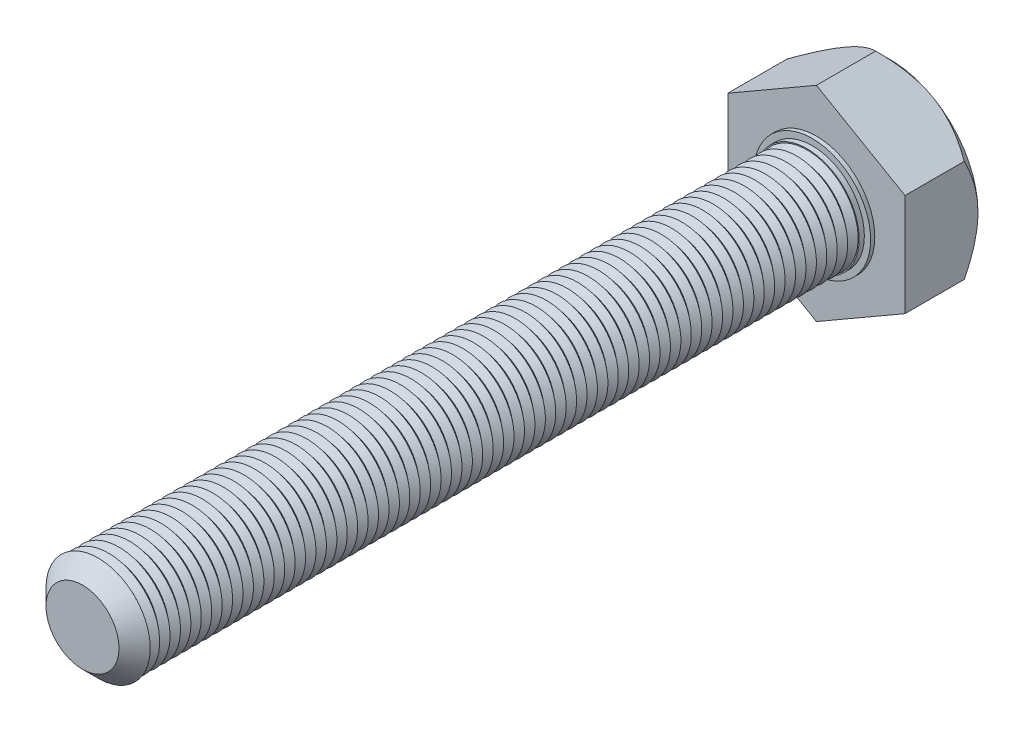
from build123d import *

# Parameters (mm, degrees)
BASE_EXTRUDE_DEPTH  = 3.5
SKETCH5_R           = 5.6
BOSS_EXTRUDE1_DEPTH = 0.4
SKETCH6_R           = 5
BOSS_EXTRUDE2_DEPTH = 70
CHAMFER1_SIZE       = 1.5
LPATTERN1_COUNT     = 68
LPATTERN1_PITCH     = 1


with BuildPart() as part:
    # Sketch1 → Base-Extrude (new, symmetric)
    with BuildSketch(Plane.XY):
        Polygon((8.5, 4.907477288), (8.5, -4.907477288), (0, -9.814954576), (-8.5, -4.907477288), (-8.5, 4.907477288), (0, 9.814954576), align=None)
    extrude(amount=BASE_EXTRUDE_DEPTH, both=True)

    # Sketch3 → Cut-Revolve1 (revolve, cut)
    with BuildSketch(Plane(origin=(0, 0, 0), x_dir=(1, 0, 0), z_dir=(0, 1, 0))):
        Polygon((-13.5, 3.5), (-8.5, 3.5), (-13.5, -1.5), align=None)
    revolve(axis=Axis((0, 0, -3.5), (0, 0, 1)), mode=Mode.SUBTRACT)

    # Sketch5 → Boss-Extrude1 (add)
    with BuildSketch(Plane.XY.offset(3.5)):
        Circle(SKETCH5_R)
    extrude(amount=BOSS_EXTRUDE1_DEPTH)

    # Sketch6 → Boss-Extrude2 (add)
    with BuildSketch(Plane.XY.offset(3.9)):
        Circle(SKETCH6_R)
    extrude(amount=BOSS_EXTRUDE2_DEPTH)

    # Chamfer1
    chamfer1_edges = [part.edges().sort_by_distance(p)[0] for p in [
        (-5, 0, 73.9),
    ]]
    chamfer(chamfer1_edges, length=CHAMFER1_SIZE)

    # Sketch7 → Cut-Revolve2 (revolve, cut)
    with BuildSketch(Plane(origin=(0, 0, 0), x_dir=(0, 0, -1), z_dir=(1, 0, 0)), mode=Mode.PRIVATE) as cut_revolve2_sk:
        Polygon((-5.4, -4.9), (-5.4, -6.9), (-4.4, -6.9), (-4.4, -4.9), (-4.9, -4.3), align=None)
    cut_revolve2 = revolve(cut_revolve2_sk.sketch.rotate(Axis((0, 0, 0), (0, 0, 1)), 270), axis=Axis((0, 0, 0), (0, 0, 1)), mode=Mode.SUBTRACT)

    # LPattern1: Cut-Revolve2 ×68
    with Locations(*[(0, 0, i * LPATTERN1_PITCH) for i in range(1, LPATTERN1_COUNT)]):
        add(cut_revolve2, mode=Mode.SUBTRACT)


solid = part.part
